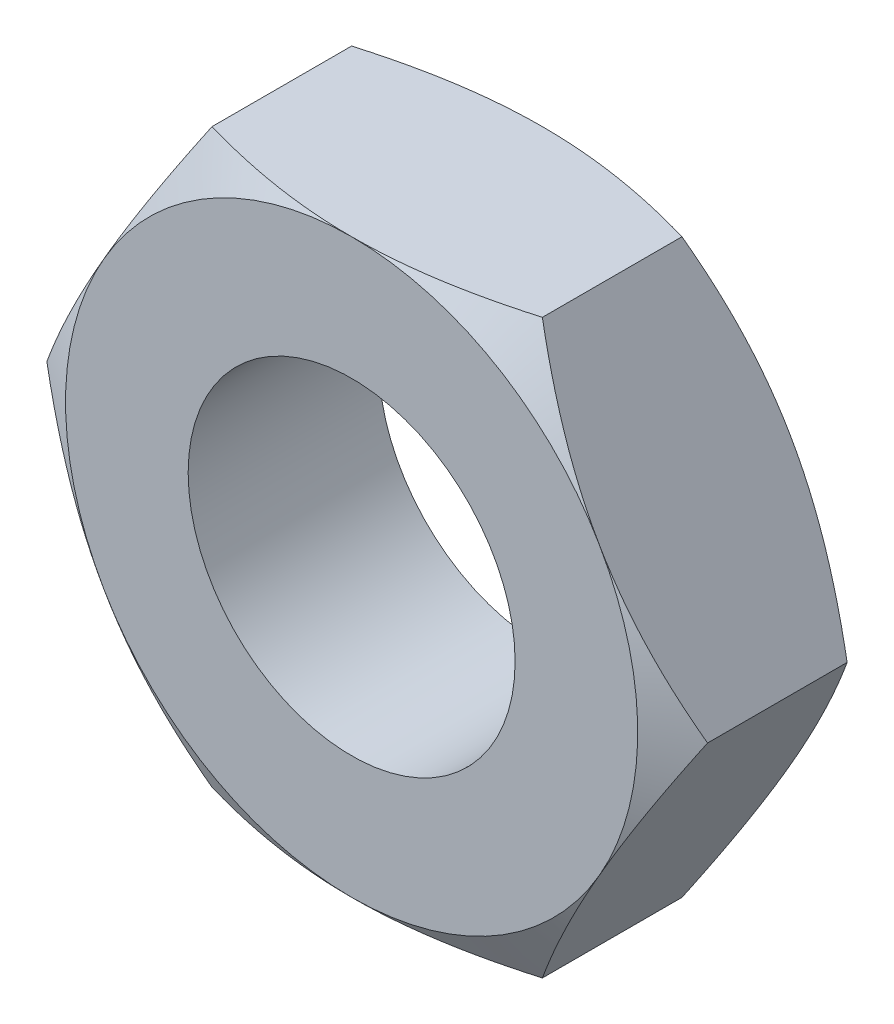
ISO-10303-21;
HEADER;
FILE_DESCRIPTION(('STEP AP214'),'2;1');
FILE_NAME('part.step','',(''),(''),'','','');
FILE_SCHEMA(('AUTOMOTIVE_DESIGN { 1 0 10303 214 1 1 1 1 }'));
ENDSEC;
DATA;
#1=APPLICATION_CONTEXT('core data for automotive mechanical design processes');
#2=APPLICATION_PROTOCOL_DEFINITION('international standard','automotive_design',2000,#1);
#3=PRODUCT_CONTEXT('',#1,'mechanical');
#4=PRODUCT('Part','Part','',(#3));
#5=PRODUCT_RELATED_PRODUCT_CATEGORY('part','',(#4));
#6=PRODUCT_DEFINITION_FORMATION('','',#4);
#7=PRODUCT_DEFINITION_CONTEXT('part definition',#1,'design');
#8=PRODUCT_DEFINITION('design','',#6,#7);
#9=PRODUCT_DEFINITION_SHAPE('','',#8);
#10=(LENGTH_UNIT() NAMED_UNIT(*) SI_UNIT(.MILLI.,.METRE.));
#11=(NAMED_UNIT(*) PLANE_ANGLE_UNIT() SI_UNIT($,.RADIAN.));
#12=(NAMED_UNIT(*) SI_UNIT($,.STERADIAN.) SOLID_ANGLE_UNIT());
#13=UNCERTAINTY_MEASURE_WITH_UNIT(LENGTH_MEASURE(1.E-05),#10,'distance_accuracy_value','');
#14=(GEOMETRIC_REPRESENTATION_CONTEXT(3) GLOBAL_UNCERTAINTY_ASSIGNED_CONTEXT((#13)) GLOBAL_UNIT_ASSIGNED_CONTEXT((#10,
#11,#12)) REPRESENTATION_CONTEXT('',''));
#15=CARTESIAN_POINT('',(0.,0.,0.));
#16=DIRECTION('',(0.,0.,1.));
#17=DIRECTION('',(1.,0.,0.));
#18=AXIS2_PLACEMENT_3D('',#15,#16,#17);
#19=CARTESIAN_POINT('',(-6.06217782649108,-10.5,3.5));
#20=DIRECTION('',(0.,1.,0.));
#21=DIRECTION('',(-1.,0.,0.));
#22=AXIS2_PLACEMENT_3D('',#19,#20,#21);
#23=PLANE('',#22);
#24=CARTESIAN_POINT('',(-16.3129856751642,-10.5,-1.63846950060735));
#25=CARTESIAN_POINT('',(-16.0835361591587,-10.5,-1.52707913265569));
#26=CARTESIAN_POINT('',(-15.8538181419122,-10.5,-1.41624209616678));
#27=CARTESIAN_POINT('',(-15.3937890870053,-10.5,-1.19579997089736));
#28=CARTESIAN_POINT('',(-15.163478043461,-10.5,-1.08619489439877));
#29=CARTESIAN_POINT('',(-14.4715103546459,-10.5,-0.75938680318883));
#30=CARTESIAN_POINT('',(-14.0088866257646,-10.5,-0.544223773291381));
#31=CARTESIAN_POINT('',(-13.0780494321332,-10.5,-0.119481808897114));
#32=CARTESIAN_POINT('',(-12.6098192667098,-10.5,0.0900606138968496));
#33=CARTESIAN_POINT('',(-11.6696450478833,-10.5,0.500610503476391));
#34=CARTESIAN_POINT('',(-11.1977011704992,-10.5,0.701618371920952));
#35=CARTESIAN_POINT('',(-10.2341376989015,-10.5,1.09911565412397));
#36=CARTESIAN_POINT('',(-9.74237234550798,-10.5,1.29525366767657));
#37=CARTESIAN_POINT('',(-8.75310081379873,-10.5,1.67275620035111));
#38=CARTESIAN_POINT('',(-8.25559400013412,-10.5,1.85411906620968));
#39=CARTESIAN_POINT('',(-7.25496302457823,-10.5,2.19733177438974));
#40=CARTESIAN_POINT('',(-6.75185245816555,-10.5,2.35922082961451));
#41=CARTESIAN_POINT('',(-5.73843328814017,-10.5,2.65831332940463));
#42=CARTESIAN_POINT('',(-5.22812699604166,-10.5,2.79552451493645));
#43=CARTESIAN_POINT('',(-4.20270898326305,-10.5,3.03797394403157));
#44=CARTESIAN_POINT('',(-3.68763862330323,-10.5,3.1433824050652));
#45=CARTESIAN_POINT('',(-2.91032009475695,-10.5,3.27307843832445));
#46=CARTESIAN_POINT('',(-2.6504099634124,-10.5,3.31157604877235));
#47=CARTESIAN_POINT('',(-2.12928788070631,-10.5,3.37834473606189));
#48=CARTESIAN_POINT('',(-1.86807605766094,-10.5,3.40661680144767));
#49=CARTESIAN_POINT('',(-1.34812810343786,-10.5,3.45201482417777));
#50=CARTESIAN_POINT('',(-1.08940434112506,-10.5,3.46928188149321));
#51=CARTESIAN_POINT('',(-0.571458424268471,-10.5,3.4928581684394));
#52=CARTESIAN_POINT('',(-0.31223627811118,-10.5,3.49916758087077));
#53=CARTESIAN_POINT('',(0.206244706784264,-10.5,3.50067798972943));
#54=CARTESIAN_POINT('',(0.465503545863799,-10.5,3.49587887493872));
#55=CARTESIAN_POINT('',(0.983587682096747,-10.5,3.47528974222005));
#56=CARTESIAN_POINT('',(1.24241295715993,-10.5,3.45949918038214));
#57=CARTESIAN_POINT('',(1.86344525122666,-10.5,3.40875885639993));
#58=CARTESIAN_POINT('',(2.22523971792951,-10.5,3.36865003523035));
#59=CARTESIAN_POINT('',(2.94614663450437,-10.5,3.26913634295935));
#60=CARTESIAN_POINT('',(3.30525871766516,-10.5,3.20972888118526));
#61=CARTESIAN_POINT('',(4.37814927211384,-10.5,3.00570854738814));
#62=CARTESIAN_POINT('',(5.087093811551,-10.5,2.83533364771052));
#63=CARTESIAN_POINT('',(6.14742972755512,-10.5,2.53978392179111));
#64=CARTESIAN_POINT('',(6.50431432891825,-10.5,2.43318380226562));
#65=CARTESIAN_POINT('',(7.21461615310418,-10.5,2.20889470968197));
#66=CARTESIAN_POINT('',(7.56803335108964,-10.5,2.09120565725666));
#67=CARTESIAN_POINT('',(8.2715143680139,-10.5,1.84662886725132));
#68=CARTESIAN_POINT('',(8.62157922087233,-10.5,1.71974407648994));
#69=CARTESIAN_POINT('',(9.31880400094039,-10.5,1.45827082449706));
#70=CARTESIAN_POINT('',(9.66596397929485,-10.5,1.32368249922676));
#71=CARTESIAN_POINT('',(10.5519074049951,-10.5,0.970716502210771));
#72=CARTESIAN_POINT('',(11.0888481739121,-10.5,0.747719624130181));
#73=CARTESIAN_POINT('',(12.1576434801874,-10.5,0.289814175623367));
#74=CARTESIAN_POINT('',(12.6894975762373,-10.5,0.0549045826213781));
#75=CARTESIAN_POINT('',(13.7491997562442,-10.5,-0.424177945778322));
#76=CARTESIAN_POINT('',(14.2770465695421,-10.5,-0.668353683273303));
#77=CARTESIAN_POINT('',(15.3293262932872,-10.5,-1.16389116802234));
#78=CARTESIAN_POINT('',(15.8537593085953,-10.5,-1.41525269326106));
#79=CARTESIAN_POINT('',(16.9005551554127,-10.5,-1.92402979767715));
#80=CARTESIAN_POINT('',(17.4229142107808,-10.5,-2.18145313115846));
#81=CARTESIAN_POINT('',(18.4653387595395,-10.5,-2.70090348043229));
#82=CARTESIAN_POINT('',(18.9854042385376,-10.5,-2.96293052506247));
#83=CARTESIAN_POINT('',(20.0235379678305,-10.5,-3.49068332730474));
#84=CARTESIAN_POINT('',(20.5416065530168,-10.5,-3.75640842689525));
#85=CARTESIAN_POINT('',(21.5761496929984,-10.5,-4.29094541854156));
#86=CARTESIAN_POINT('',(22.0926242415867,-10.5,-4.55975732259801));
#87=CARTESIAN_POINT('',(23.5406536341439,-10.5,-5.31798326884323));
#88=CARTESIAN_POINT('',(24.4706923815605,-10.5,-5.81029230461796));
#89=CARTESIAN_POINT('',(26.327550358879,-10.5,-6.80103892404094));
#90=CARTESIAN_POINT('',(27.2543694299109,-10.5,-7.29947680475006));
#91=CARTESIAN_POINT('',(29.1028024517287,-10.5,-8.29950657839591));
#92=CARTESIAN_POINT('',(30.0244236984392,-10.5,-8.80108499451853));
#93=CARTESIAN_POINT('',(31.4053681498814,-10.5,-9.55609790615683));
#94=CARTESIAN_POINT('',(31.8654200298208,-10.5,-9.80820146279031));
#95=CARTESIAN_POINT('',(32.7850886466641,-10.5,-10.3131996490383));
#96=CARTESIAN_POINT('',(33.2447053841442,-10.5,-10.5660942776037));
#97=CARTESIAN_POINT('',(33.7041304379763,-10.5,-10.8193367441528));
#98=B_SPLINE_CURVE_WITH_KNOTS('',3,(#24,#25,#26,#27,#28,#29,#30,#31,#32,#33,#34,#35,#36,#37,#38,
#39,#40,#41,#42,#43,#44,#45,#46,#47,#48,#49,#50,#51,#52,#53,#54,#55,#56,#57,#58,#59,#60,#61,#62,
#63,#64,#65,#66,#67,#68,#69,#70,#71,#72,#73,#74,#75,#76,#77,#78,#79,#80,#81,#82,#83,#84,#85,#86,
#87,#88,#89,#90,#91,#92,#93,#94,#95,#96,#97),.UNSPECIFIED.,.F.,.F.,(4,2,2,2,2,2,2,2,2,2,2,2,2,2,
2,2,2,2,2,2,2,2,2,2,2,2,2,2,2,2,2,2,2,2,2,2,4),(0.,0.765174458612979,1.53035653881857,
3.06094582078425,4.59981642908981,6.13861453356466,7.72674066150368,9.31504424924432,
10.9000940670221,12.484645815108,14.0605596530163,14.8486275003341,15.6366191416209,
16.4142928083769,17.1919535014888,17.9696219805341,18.7473289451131,19.8387459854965,
20.9303095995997,23.1146012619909,24.231902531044,25.3492117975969,26.4661645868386,
27.5830976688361,29.3271090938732,31.0712704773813,32.8159635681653,34.5606028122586,
36.3076101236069,38.0546283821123,39.8013396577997,41.5480577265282,44.7049294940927,
47.8619548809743,51.009752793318,52.5835487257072,54.1573425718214),.UNSPECIFIED.);
#99=CARTESIAN_POINT('',(-6.06217782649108,-10.5,2.56217782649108));
#100=VERTEX_POINT('',#99);
#101=CARTESIAN_POINT('',(0.,-10.5,3.5));
#102=VERTEX_POINT('',#101);
#103=EDGE_CURVE('E319',#100,#102,#98,.T.);
#104=ORIENTED_EDGE('',*,*,#103,.F.);
#105=DIRECTION('',(0.,0.,-1.));
#106=VECTOR('',#105,1.);
#107=CARTESIAN_POINT('',(-6.06217782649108,-10.5,3.5));
#108=LINE('',#107,#106);
#109=CARTESIAN_POINT('',(-6.06217782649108,-10.5,-2.56217782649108));
#110=VERTEX_POINT('',#109);
#111=EDGE_CURVE('E228',#100,#110,#108,.T.);
#112=ORIENTED_EDGE('',*,*,#111,.T.);
#113=CARTESIAN_POINT('',(-16.3129856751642,-10.5,1.63846950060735));
#114=CARTESIAN_POINT('',(-16.0835361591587,-10.5,1.52707913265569));
#115=CARTESIAN_POINT('',(-15.8538181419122,-10.5,1.41624209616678));
#116=CARTESIAN_POINT('',(-15.3937890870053,-10.5,1.19579997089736));
#117=CARTESIAN_POINT('',(-15.163478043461,-10.5,1.08619489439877));
#118=CARTESIAN_POINT('',(-14.4715103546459,-10.5,0.75938680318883));
#119=CARTESIAN_POINT('',(-14.0088866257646,-10.5,0.544223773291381));
#120=CARTESIAN_POINT('',(-13.0780494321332,-10.5,0.119481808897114));
#121=CARTESIAN_POINT('',(-12.6098192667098,-10.5,-0.0900606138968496));
#122=CARTESIAN_POINT('',(-11.6696450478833,-10.5,-0.500610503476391));
#123=CARTESIAN_POINT('',(-11.1977011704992,-10.5,-0.701618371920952));
#124=CARTESIAN_POINT('',(-10.2341376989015,-10.5,-1.09911565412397));
#125=CARTESIAN_POINT('',(-9.74237234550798,-10.5,-1.29525366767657));
#126=CARTESIAN_POINT('',(-8.75310081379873,-10.5,-1.67275620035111));
#127=CARTESIAN_POINT('',(-8.25559400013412,-10.5,-1.85411906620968));
#128=CARTESIAN_POINT('',(-7.25496302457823,-10.5,-2.19733177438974));
#129=CARTESIAN_POINT('',(-6.75185245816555,-10.5,-2.35922082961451));
#130=CARTESIAN_POINT('',(-5.73843328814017,-10.5,-2.65831332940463));
#131=CARTESIAN_POINT('',(-5.22812699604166,-10.5,-2.79552451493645));
#132=CARTESIAN_POINT('',(-4.20270898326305,-10.5,-3.03797394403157));
#133=CARTESIAN_POINT('',(-3.68763862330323,-10.5,-3.1433824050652));
#134=CARTESIAN_POINT('',(-2.91032009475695,-10.5,-3.27307843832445));
#135=CARTESIAN_POINT('',(-2.6504099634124,-10.5,-3.31157604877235));
#136=CARTESIAN_POINT('',(-2.12928788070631,-10.5,-3.37834473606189));
#137=CARTESIAN_POINT('',(-1.86807605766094,-10.5,-3.40661680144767));
#138=CARTESIAN_POINT('',(-1.34812810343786,-10.5,-3.45201482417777));
#139=CARTESIAN_POINT('',(-1.08940434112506,-10.5,-3.46928188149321));
#140=CARTESIAN_POINT('',(-0.571458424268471,-10.5,-3.4928581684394));
#141=CARTESIAN_POINT('',(-0.31223627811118,-10.5,-3.49916758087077));
#142=CARTESIAN_POINT('',(0.206244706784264,-10.5,-3.50067798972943));
#143=CARTESIAN_POINT('',(0.465503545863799,-10.5,-3.49587887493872));
#144=CARTESIAN_POINT('',(0.983587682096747,-10.5,-3.47528974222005));
#145=CARTESIAN_POINT('',(1.24241295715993,-10.5,-3.45949918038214));
#146=CARTESIAN_POINT('',(1.86344525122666,-10.5,-3.40875885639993));
#147=CARTESIAN_POINT('',(2.22523971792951,-10.5,-3.36865003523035));
#148=CARTESIAN_POINT('',(2.94614663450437,-10.5,-3.26913634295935));
#149=CARTESIAN_POINT('',(3.30525871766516,-10.5,-3.20972888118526));
#150=CARTESIAN_POINT('',(4.37814927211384,-10.5,-3.00570854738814));
#151=CARTESIAN_POINT('',(5.087093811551,-10.5,-2.83533364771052));
#152=CARTESIAN_POINT('',(6.14742972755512,-10.5,-2.53978392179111));
#153=CARTESIAN_POINT('',(6.50431432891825,-10.5,-2.43318380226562));
#154=CARTESIAN_POINT('',(7.21461615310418,-10.5,-2.20889470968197));
#155=CARTESIAN_POINT('',(7.56803335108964,-10.5,-2.09120565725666));
#156=CARTESIAN_POINT('',(8.2715143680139,-10.5,-1.84662886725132));
#157=CARTESIAN_POINT('',(8.62157922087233,-10.5,-1.71974407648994));
#158=CARTESIAN_POINT('',(9.31880400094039,-10.5,-1.45827082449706));
#159=CARTESIAN_POINT('',(9.66596397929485,-10.5,-1.32368249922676));
#160=CARTESIAN_POINT('',(10.5519074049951,-10.5,-0.970716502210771));
#161=CARTESIAN_POINT('',(11.0888481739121,-10.5,-0.747719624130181));
#162=CARTESIAN_POINT('',(12.1576434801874,-10.5,-0.289814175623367));
#163=CARTESIAN_POINT('',(12.6894975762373,-10.5,-0.0549045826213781));
#164=CARTESIAN_POINT('',(13.7491997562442,-10.5,0.424177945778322));
#165=CARTESIAN_POINT('',(14.2770465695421,-10.5,0.668353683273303));
#166=CARTESIAN_POINT('',(15.3293262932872,-10.5,1.16389116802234));
#167=CARTESIAN_POINT('',(15.8537593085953,-10.5,1.41525269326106));
#168=CARTESIAN_POINT('',(16.9005551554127,-10.5,1.92402979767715));
#169=CARTESIAN_POINT('',(17.4229142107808,-10.5,2.18145313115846));
#170=CARTESIAN_POINT('',(18.4653387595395,-10.5,2.70090348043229));
#171=CARTESIAN_POINT('',(18.9854042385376,-10.5,2.96293052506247));
#172=CARTESIAN_POINT('',(20.0235379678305,-10.5,3.49068332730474));
#173=CARTESIAN_POINT('',(20.5416065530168,-10.5,3.75640842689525));
#174=CARTESIAN_POINT('',(21.5761496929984,-10.5,4.29094541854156));
#175=CARTESIAN_POINT('',(22.0926242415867,-10.5,4.55975732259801));
#176=CARTESIAN_POINT('',(23.5406536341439,-10.5,5.31798326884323));
#177=CARTESIAN_POINT('',(24.4706923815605,-10.5,5.81029230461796));
#178=CARTESIAN_POINT('',(26.327550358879,-10.5,6.80103892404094));
#179=CARTESIAN_POINT('',(27.2543694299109,-10.5,7.29947680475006));
#180=CARTESIAN_POINT('',(29.1028024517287,-10.5,8.29950657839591));
#181=CARTESIAN_POINT('',(30.0244236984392,-10.5,8.80108499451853));
#182=CARTESIAN_POINT('',(31.4053681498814,-10.5,9.55609790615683));
#183=CARTESIAN_POINT('',(31.8654200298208,-10.5,9.80820146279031));
#184=CARTESIAN_POINT('',(32.7850886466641,-10.5,10.3131996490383));
#185=CARTESIAN_POINT('',(33.2447053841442,-10.5,10.5660942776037));
#186=CARTESIAN_POINT('',(33.7041304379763,-10.5,10.8193367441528));
#187=B_SPLINE_CURVE_WITH_KNOTS('',3,(#113,#114,#115,#116,#117,#118,#119,#120,#121,#122,#123,
#124,#125,#126,#127,#128,#129,#130,#131,#132,#133,#134,#135,#136,#137,#138,#139,#140,#141,#142,
#143,#144,#145,#146,#147,#148,#149,#150,#151,#152,#153,#154,#155,#156,#157,#158,#159,#160,#161,
#162,#163,#164,#165,#166,#167,#168,#169,#170,#171,#172,#173,#174,#175,#176,#177,#178,#179,#180,
#181,#182,#183,#184,#185,#186),.UNSPECIFIED.,.F.,.F.,(4,2,2,2,2,2,2,2,2,2,2,2,2,2,2,2,2,2,2,2,2,
2,2,2,2,2,2,2,2,2,2,2,2,2,2,2,4),(0.,0.765174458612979,1.53035653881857,3.06094582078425,
4.59981642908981,6.13861453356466,7.72674066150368,9.31504424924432,10.9000940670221,
12.484645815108,14.0605596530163,14.8486275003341,15.6366191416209,16.4142928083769,
17.1919535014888,17.9696219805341,18.7473289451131,19.8387459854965,20.9303095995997,
23.1146012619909,24.231902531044,25.3492117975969,26.4661645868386,27.5830976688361,
29.3271090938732,31.0712704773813,32.8159635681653,34.5606028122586,36.3076101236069,
38.0546283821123,39.8013396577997,41.5480577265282,44.7049294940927,47.8619548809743,
51.009752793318,52.5835487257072,54.1573425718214),.UNSPECIFIED.);
#188=CARTESIAN_POINT('',(0.,-10.5,-3.5));
#189=VERTEX_POINT('',#188);
#190=EDGE_CURVE('E282',#189,#110,#187,.F.);
#191=ORIENTED_EDGE('',*,*,#190,.F.);
#192=CARTESIAN_POINT('',(6.0621778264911,-10.5,-2.56217782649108));
#193=VERTEX_POINT('',#192);
#194=EDGE_CURVE('E51',#193,#189,#187,.F.);
#195=ORIENTED_EDGE('',*,*,#194,.F.);
#196=DIRECTION('',(0.,0.,-1.));
#197=VECTOR('',#196,1.);
#198=CARTESIAN_POINT('',(6.0621778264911,-10.5,3.5));
#199=LINE('',#198,#197);
#200=CARTESIAN_POINT('',(6.0621778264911,-10.5,2.56217782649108));
#201=VERTEX_POINT('',#200);
#202=EDGE_CURVE('E237',#201,#193,#199,.T.);
#203=ORIENTED_EDGE('',*,*,#202,.F.);
#204=EDGE_CURVE('E195',#102,#201,#98,.T.);
#205=ORIENTED_EDGE('',*,*,#204,.F.);
#206=EDGE_LOOP('',(#104,#112,#191,#195,#203,#205));
#207=FACE_BOUND('',#206,.T.);
#208=ADVANCED_FACE('F29',(#207),#23,.F.);
#209=CARTESIAN_POINT('',(6.0621778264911,-10.5,3.5));
#210=DIRECTION('',(-0.866025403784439,0.5,0.));
#211=DIRECTION('',(-0.5,-0.866025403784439,0.));
#212=AXIS2_PLACEMENT_3D('',#209,#210,#211);
#213=PLANE('',#212);
#214=CARTESIAN_POINT('',(6.06206235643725,-10.5002,2.56211115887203));
#215=CARTESIAN_POINT('',(6.19532217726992,-10.2693872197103,2.63903608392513));
#216=CARTESIAN_POINT('',(6.32907886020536,-10.0377138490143,2.71246961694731));
#217=CARTESIAN_POINT('',(6.59766485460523,-9.57250926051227,2.85138514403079));
#218=CARTESIAN_POINT('',(6.73249450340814,-9.33897745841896,2.91686452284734));
#219=CARTESIAN_POINT('',(7.13915595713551,-8.63461915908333,3.10010423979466));
#220=CARTESIAN_POINT('',(7.4125931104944,-8.16101211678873,3.20433004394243));
#221=CARTESIAN_POINT('',(7.82177929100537,-7.45228086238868,3.32654435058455));
#222=CARTESIAN_POINT('',(7.95630585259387,-7.21927402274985,3.36135857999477));
#223=CARTESIAN_POINT('',(8.22598182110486,-6.75218154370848,3.41973973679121));
#224=CARTESIAN_POINT('',(8.36113123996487,-6.51809588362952,3.44330644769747));
#225=CARTESIAN_POINT('',(8.63165551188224,-6.04953409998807,3.47858873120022));
#226=CARTESIAN_POINT('',(8.76702990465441,-5.81505877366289,3.49031838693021));
#227=CARTESIAN_POINT('',(9.03790372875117,-5.3458915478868,3.50167731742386));
#228=CARTESIAN_POINT('',(9.17340315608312,-5.11119965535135,3.50130696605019));
#229=CARTESIAN_POINT('',(9.42672188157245,-4.67243875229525,3.48930773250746));
#230=CARTESIAN_POINT('',(9.544559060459,-4.4683387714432,3.47914260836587));
#231=CARTESIAN_POINT('',(9.77995782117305,-4.06061615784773,3.44985839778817));
#232=CARTESIAN_POINT('',(9.89751938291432,-3.8569935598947,3.4307386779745));
#233=CARTESIAN_POINT('',(10.2497485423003,-3.24691475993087,3.3603996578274));
#234=CARTESIAN_POINT('',(10.4837926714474,-2.84153843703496,3.29620926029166));
#235=CARTESIAN_POINT('',(10.9543635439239,-2.02648577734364,3.13573291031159));
#236=CARTESIAN_POINT('',(11.1908302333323,-1.61691345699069,3.03876673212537));
#237=CARTESIAN_POINT('',(11.6602373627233,-0.803876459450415,2.81869386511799));
#238=CARTESIAN_POINT('',(11.8931838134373,-0.400401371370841,2.6956388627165));
#239=CARTESIAN_POINT('',(12.124471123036,0.000200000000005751,2.56211115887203));
#240=B_SPLINE_CURVE_WITH_KNOTS('',3,(#214,#215,#216,#217,#218,#219,#220,#221,#222,#223,#224,
#225,#226,#227,#228,#229,#230,#231,#232,#233,#234,#235,#236,#237,#238,#239),.UNSPECIFIED.,.F.,
.F.,(4,2,2,2,2,2,2,2,2,2,2,2,4),(0.,0.832130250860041,1.66453336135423,3.33288308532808,
4.14658222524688,4.9602970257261,5.77304256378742,6.58576298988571,7.29326708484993,
8.00082123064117,9.41693497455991,10.864454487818,12.3091325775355),.UNSPECIFIED.);
#241=CARTESIAN_POINT('',(9.09326673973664,-5.25,3.5));
#242=VERTEX_POINT('',#241);
#243=EDGE_CURVE('E193',#201,#242,#240,.T.);
#244=ORIENTED_EDGE('',*,*,#243,.F.);
#245=ORIENTED_EDGE('',*,*,#202,.T.);
#246=CARTESIAN_POINT('',(12.124471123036,0.000200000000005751,-2.56211115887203));
#247=CARTESIAN_POINT('',(11.9912113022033,-0.230612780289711,-2.63903608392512));
#248=CARTESIAN_POINT('',(11.8574546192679,-0.462286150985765,-2.71246961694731));
#249=CARTESIAN_POINT('',(11.588868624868,-0.927490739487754,-2.85138514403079));
#250=CARTESIAN_POINT('',(11.4540389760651,-1.16102254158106,-2.91686452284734));
#251=CARTESIAN_POINT('',(11.0473775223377,-1.86538084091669,-3.10010423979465));
#252=CARTESIAN_POINT('',(10.7739403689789,-2.33898788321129,-3.20433004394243));
#253=CARTESIAN_POINT('',(10.3647541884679,-3.04771913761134,-3.32654435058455));
#254=CARTESIAN_POINT('',(10.2302276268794,-3.28072597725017,-3.36135857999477));
#255=CARTESIAN_POINT('',(9.9605516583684,-3.74781845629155,-3.4197397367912));
#256=CARTESIAN_POINT('',(9.82540223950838,-3.9819041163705,-3.44330644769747));
#257=CARTESIAN_POINT('',(9.55487796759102,-4.45046590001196,-3.47858873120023));
#258=CARTESIAN_POINT('',(9.41950357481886,-4.68494122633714,-3.49031838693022));
#259=CARTESIAN_POINT('',(9.14862975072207,-5.15410845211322,-3.50167731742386));
#260=CARTESIAN_POINT('',(9.01313032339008,-5.38880034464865,-3.50130696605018));
#261=CARTESIAN_POINT('',(8.75981159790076,-5.82756124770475,-3.48930773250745));
#262=CARTESIAN_POINT('',(8.64197441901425,-6.03166122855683,-3.47914260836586));
#263=CARTESIAN_POINT('',(8.40657565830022,-6.43938384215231,-3.44985839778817));
#264=CARTESIAN_POINT('',(8.28901409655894,-6.64300644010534,-3.4307386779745));
#265=CARTESIAN_POINT('',(7.93678493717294,-7.25308524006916,-3.36039965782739));
#266=CARTESIAN_POINT('',(7.70274080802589,-7.65846156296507,-3.29620926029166));
#267=CARTESIAN_POINT('',(7.23216993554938,-8.47351422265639,-3.13573291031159));
#268=CARTESIAN_POINT('',(6.99570324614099,-8.88308654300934,-3.03876673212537));
#269=CARTESIAN_POINT('',(6.52629611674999,-9.69612354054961,-2.81869386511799));
#270=CARTESIAN_POINT('',(6.29334966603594,-10.0995986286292,-2.6956388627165));
#271=CARTESIAN_POINT('',(6.06206235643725,-10.5002,-2.56211115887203));
#272=B_SPLINE_CURVE_WITH_KNOTS('',3,(#246,#247,#248,#249,#250,#251,#252,#253,#254,#255,#256,
#257,#258,#259,#260,#261,#262,#263,#264,#265,#266,#267,#268,#269,#270,#271),.UNSPECIFIED.,.F.,
.F.,(4,2,2,2,2,2,2,2,2,2,2,2,4),(0.,0.832130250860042,1.66453336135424,3.33288308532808,
4.14658222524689,4.96029702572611,5.77304256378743,6.58576298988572,7.29326708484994,
8.00082123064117,9.41693497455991,10.864454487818,12.3091325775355),.UNSPECIFIED.);
#273=CARTESIAN_POINT('',(9.09326673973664,-5.25,-3.5));
#274=VERTEX_POINT('',#273);
#275=EDGE_CURVE('E208',#274,#193,#272,.T.);
#276=ORIENTED_EDGE('',*,*,#275,.F.);
#277=CARTESIAN_POINT('',(12.1243556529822,0.,-2.56217782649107));
#278=VERTEX_POINT('',#277);
#279=EDGE_CURVE('E214',#278,#274,#272,.T.);
#280=ORIENTED_EDGE('',*,*,#279,.F.);
#281=DIRECTION('',(0.,0.,-1.));
#282=VECTOR('',#281,1.);
#283=CARTESIAN_POINT('',(12.1243556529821,0.,3.5));
#284=LINE('',#283,#282);
#285=CARTESIAN_POINT('',(12.1243556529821,0.,2.56217782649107));
#286=VERTEX_POINT('',#285);
#287=EDGE_CURVE('E235',#286,#278,#284,.T.);
#288=ORIENTED_EDGE('',*,*,#287,.F.);
#289=EDGE_CURVE('E189',#242,#286,#240,.T.);
#290=ORIENTED_EDGE('',*,*,#289,.F.);
#291=EDGE_LOOP('',(#244,#245,#276,#280,#288,#290));
#292=FACE_BOUND('',#291,.T.);
#293=ADVANCED_FACE('F200',(#292),#213,.F.);
#294=CARTESIAN_POINT('',(12.1243556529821,0.,3.5));
#295=DIRECTION('',(-0.866025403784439,-0.5,0.));
#296=DIRECTION('',(0.5,-0.866025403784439,0.));
#297=AXIS2_PLACEMENT_3D('',#294,#295,#296);
#298=PLANE('',#297);
#299=CARTESIAN_POINT('',(12.124471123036,-0.000199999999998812,2.56211115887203));
#300=CARTESIAN_POINT('',(11.9912113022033,0.230612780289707,2.63903608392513));
#301=CARTESIAN_POINT('',(11.8574546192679,0.462286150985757,2.71246961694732));
#302=CARTESIAN_POINT('',(11.588868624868,0.927490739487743,2.8513851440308));
#303=CARTESIAN_POINT('',(11.4540389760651,1.16102254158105,2.91686452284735));
#304=CARTESIAN_POINT('',(11.0473775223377,1.86538084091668,3.10010423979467));
#305=CARTESIAN_POINT('',(10.7739403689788,2.33898788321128,3.20433004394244));
#306=CARTESIAN_POINT('',(10.3647541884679,3.04771913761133,3.32654435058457));
#307=CARTESIAN_POINT('',(10.2302276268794,3.28072597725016,3.36135857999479));
#308=CARTESIAN_POINT('',(9.96055165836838,3.74781845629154,3.41973973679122));
#309=CARTESIAN_POINT('',(9.82540223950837,3.98190411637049,3.44330644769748));
#310=CARTESIAN_POINT('',(9.554877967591,4.45046590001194,3.47858873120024));
#311=CARTESIAN_POINT('',(9.41950357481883,4.68494122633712,3.49031838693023));
#312=CARTESIAN_POINT('',(9.14862975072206,5.15410845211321,3.50167731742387));
#313=CARTESIAN_POINT('',(9.0131303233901,5.38880034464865,3.50130696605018));
#314=CARTESIAN_POINT('',(8.75981159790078,5.82756124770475,3.48930773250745));
#315=CARTESIAN_POINT('',(8.64197441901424,6.03166122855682,3.47914260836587));
#316=CARTESIAN_POINT('',(8.4065756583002,6.43938384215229,3.44985839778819));
#317=CARTESIAN_POINT('',(8.28901409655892,6.64300644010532,3.43073867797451));
#318=CARTESIAN_POINT('',(7.93678493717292,7.25308524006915,3.36039965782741));
#319=CARTESIAN_POINT('',(7.70274080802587,7.65846156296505,3.29620926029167));
#320=CARTESIAN_POINT('',(7.23216993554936,8.47351422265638,3.1357329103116));
#321=CARTESIAN_POINT('',(6.99570324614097,8.88308654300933,3.03876673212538));
#322=CARTESIAN_POINT('',(6.52629611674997,9.6961235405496,2.81869386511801));
#323=CARTESIAN_POINT('',(6.29334966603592,10.0995986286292,2.69563886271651));
#324=CARTESIAN_POINT('',(6.06206235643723,10.5002,2.56211115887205));
#325=B_SPLINE_CURVE_WITH_KNOTS('',3,(#299,#300,#301,#302,#303,#304,#305,#306,#307,#308,#309,
#310,#311,#312,#313,#314,#315,#316,#317,#318,#319,#320,#321,#322,#323,#324),.UNSPECIFIED.,.F.,
.F.,(4,2,2,2,2,2,2,2,2,2,2,2,4),(0.,0.832130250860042,1.66453336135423,3.33288308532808,
4.14658222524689,4.9602970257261,5.77304256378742,6.58576298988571,7.29326708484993,
8.00082123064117,9.41693497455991,10.864454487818,12.3091325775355),.UNSPECIFIED.);
#326=CARTESIAN_POINT('',(9.09326673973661,5.25,3.5));
#327=VERTEX_POINT('',#326);
#328=EDGE_CURVE('E194',#286,#327,#325,.T.);
#329=ORIENTED_EDGE('',*,*,#328,.F.);
#330=ORIENTED_EDGE('',*,*,#287,.T.);
#331=CARTESIAN_POINT('',(6.06206235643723,10.5002,-2.56211115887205));
#332=CARTESIAN_POINT('',(6.1953221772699,10.2693872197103,-2.63903608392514));
#333=CARTESIAN_POINT('',(6.32907886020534,10.0377138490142,-2.71246961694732));
#334=CARTESIAN_POINT('',(6.59766485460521,9.57250926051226,-2.8513851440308));
#335=CARTESIAN_POINT('',(6.73249450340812,9.33897745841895,-2.91686452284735));
#336=CARTESIAN_POINT('',(7.13915595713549,8.63461915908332,-3.10010423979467));
#337=CARTESIAN_POINT('',(7.41259311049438,8.16101211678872,-3.20433004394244));
#338=CARTESIAN_POINT('',(7.82177929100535,7.45228086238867,-3.32654435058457));
#339=CARTESIAN_POINT('',(7.95630585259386,7.21927402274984,-3.36135857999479));
#340=CARTESIAN_POINT('',(8.22598182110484,6.75218154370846,-3.41973973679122));
#341=CARTESIAN_POINT('',(8.36113123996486,6.51809588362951,-3.44330644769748));
#342=CARTESIAN_POINT('',(8.63165551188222,6.04953409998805,-3.47858873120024));
#343=CARTESIAN_POINT('',(8.76702990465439,5.81505877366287,-3.49031838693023));
#344=CARTESIAN_POINT('',(9.03790372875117,5.34589154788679,-3.50167731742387));
#345=CARTESIAN_POINT('',(9.17340315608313,5.11119965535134,-3.50130696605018));
#346=CARTESIAN_POINT('',(9.42672188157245,4.67243875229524,-3.48930773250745));
#347=CARTESIAN_POINT('',(9.54455906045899,4.46833877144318,-3.47914260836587));
#348=CARTESIAN_POINT('',(9.77995782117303,4.06061615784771,-3.44985839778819));
#349=CARTESIAN_POINT('',(9.8975193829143,3.85699355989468,-3.43073867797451));
#350=CARTESIAN_POINT('',(10.2497485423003,3.24691475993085,-3.3603996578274));
#351=CARTESIAN_POINT('',(10.4837926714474,2.84153843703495,-3.29620926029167));
#352=CARTESIAN_POINT('',(10.9543635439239,2.02648577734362,-3.1357329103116));
#353=CARTESIAN_POINT('',(11.1908302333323,1.61691345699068,-3.03876673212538));
#354=CARTESIAN_POINT('',(11.6602373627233,0.803876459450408,-2.818693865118));
#355=CARTESIAN_POINT('',(11.8931838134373,0.400401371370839,-2.69563886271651));
#356=CARTESIAN_POINT('',(12.124471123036,-0.000199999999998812,-2.56211115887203));
#357=B_SPLINE_CURVE_WITH_KNOTS('',3,(#331,#332,#333,#334,#335,#336,#337,#338,#339,#340,#341,
#342,#343,#344,#345,#346,#347,#348,#349,#350,#351,#352,#353,#354,#355,#356),.UNSPECIFIED.,.F.,
.F.,(4,2,2,2,2,2,2,2,2,2,2,2,4),(0.,0.832130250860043,1.66453336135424,3.33288308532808,
4.14658222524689,4.96029702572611,5.77304256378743,6.58576298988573,7.29326708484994,
8.00082123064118,9.41693497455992,10.864454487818,12.3091325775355),.UNSPECIFIED.);
#358=CARTESIAN_POINT('',(9.09326673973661,5.25,-3.5));
#359=VERTEX_POINT('',#358);
#360=EDGE_CURVE('E220',#359,#278,#357,.T.);
#361=ORIENTED_EDGE('',*,*,#360,.F.);
#362=CARTESIAN_POINT('',(6.06217782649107,10.5,-2.56217782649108));
#363=VERTEX_POINT('',#362);
#364=EDGE_CURVE('E226',#363,#359,#357,.T.);
#365=ORIENTED_EDGE('',*,*,#364,.F.);
#366=DIRECTION('',(0.,0.,-1.));
#367=VECTOR('',#366,1.);
#368=CARTESIAN_POINT('',(6.06217782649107,10.5,3.5));
#369=LINE('',#368,#367);
#370=CARTESIAN_POINT('',(6.06217782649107,10.5,2.56217782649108));
#371=VERTEX_POINT('',#370);
#372=EDGE_CURVE('E233',#371,#363,#369,.T.);
#373=ORIENTED_EDGE('',*,*,#372,.F.);
#374=EDGE_CURVE('E183',#327,#371,#325,.T.);
#375=ORIENTED_EDGE('',*,*,#374,.F.);
#376=EDGE_LOOP('',(#329,#330,#361,#365,#373,#375));
#377=FACE_BOUND('',#376,.T.);
#378=ADVANCED_FACE('F203',(#377),#298,.F.);
#379=CARTESIAN_POINT('',(6.06217782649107,10.5,3.5));
#380=DIRECTION('',(0.,-1.,0.));
#381=DIRECTION('',(1.,0.,0.));
#382=AXIS2_PLACEMENT_3D('',#379,#380,#381);
#383=PLANE('',#382);
#384=CARTESIAN_POINT('',(-16.3129856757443,10.5,-1.63846950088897));
#385=CARTESIAN_POINT('',(-16.0835361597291,10.5,-1.52707913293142));
#386=CARTESIAN_POINT('',(-15.8538181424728,10.5,-1.41624209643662));
#387=CARTESIAN_POINT('',(-15.3937890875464,10.5,-1.19579997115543));
#388=CARTESIAN_POINT('',(-15.1634780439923,10.5,-1.08619489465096));
#389=CARTESIAN_POINT('',(-14.4715103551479,10.5,-0.759386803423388));
#390=CARTESIAN_POINT('',(-14.008886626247,10.5,-0.544223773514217));
#391=CARTESIAN_POINT('',(-13.0780494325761,10.5,-0.119481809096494));
#392=CARTESIAN_POINT('',(-12.6098192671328,10.5,0.0900606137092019));
#393=CARTESIAN_POINT('',(-11.6696450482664,10.5,0.500610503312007));
#394=CARTESIAN_POINT('',(-11.1977011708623,10.5,0.701618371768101));
#395=CARTESIAN_POINT('',(-10.2341376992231,10.5,1.09911565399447));
#396=CARTESIAN_POINT('',(-9.74237234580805,10.5,1.29525366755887));
#397=CARTESIAN_POINT('',(-8.75310081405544,10.5,1.67275620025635));
#398=CARTESIAN_POINT('',(-8.25559400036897,10.5,1.85411906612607));
#399=CARTESIAN_POINT('',(-7.25496302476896,10.5,2.19733177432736));
#400=CARTESIAN_POINT('',(-6.75185245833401,10.5,2.35922082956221));
#401=CARTESIAN_POINT('',(-5.7384332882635,10.5,2.65831332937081));
#402=CARTESIAN_POINT('',(-5.22812699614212,10.5,2.79552451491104));
#403=CARTESIAN_POINT('',(-4.20270898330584,10.5,3.03797394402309));
#404=CARTESIAN_POINT('',(-3.68763862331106,10.5,3.14338240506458));
#405=CARTESIAN_POINT('',(-2.91032009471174,10.5,3.27307843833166));
#406=CARTESIAN_POINT('',(-2.65040996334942,10.5,3.3115760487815));
#407=CARTESIAN_POINT('',(-2.12928788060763,10.5,3.37834473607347));
#408=CARTESIAN_POINT('',(-1.86807605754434,10.5,3.40661680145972));
#409=CARTESIAN_POINT('',(-1.34812810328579,10.5,3.45201482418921));
#410=CARTESIAN_POINT('',(-1.08940434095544,10.5,3.46928188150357));
#411=CARTESIAN_POINT('',(-0.571458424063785,10.5,3.49285816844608));
#412=CARTESIAN_POINT('',(-0.312236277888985,10.5,3.49916758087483));
#413=CARTESIAN_POINT('',(0.206244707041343,10.5,3.50067798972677));
#414=CARTESIAN_POINT('',(0.465503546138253,10.5,3.49587887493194));
#415=CARTESIAN_POINT('',(0.983587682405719,10.5,3.47528974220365));
#416=CARTESIAN_POINT('',(1.24241295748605,10.5,3.45949918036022));
#417=CARTESIAN_POINT('',(1.86344525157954,10.5,3.40875885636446));
#418=CARTESIAN_POINT('',(2.22523971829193,10.5,3.36865003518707));
#419=CARTESIAN_POINT('',(2.94614663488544,10.5,3.26913634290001));
#420=CARTESIAN_POINT('',(3.30525871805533,10.5,3.20972888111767));
#421=CARTESIAN_POINT('',(4.37814927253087,10.5,3.00570854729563));
#422=CARTESIAN_POINT('',(5.08709381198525,10.5,2.83533364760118));
#423=CARTESIAN_POINT('',(6.14742972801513,10.5,2.53978392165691));
#424=CARTESIAN_POINT('',(6.50431432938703,10.5,2.43318380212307));
#425=CARTESIAN_POINT('',(7.2146161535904,10.5,2.20889470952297));
#426=CARTESIAN_POINT('',(7.56803335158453,10.5,2.09120565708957));
#427=CARTESIAN_POINT('',(8.27151436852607,10.5,1.8466288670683));
#428=CARTESIAN_POINT('',(8.62157922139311,10.5,1.71974407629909));
#429=CARTESIAN_POINT('',(9.31880400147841,10.5,1.45827082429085));
#430=CARTESIAN_POINT('',(9.66596397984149,10.5,1.323682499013));
#431=CARTESIAN_POINT('',(10.5519074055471,10.5,0.970716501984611));
#432=CARTESIAN_POINT('',(11.0888481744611,10.5,0.747719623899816));
#433=CARTESIAN_POINT('',(12.1576434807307,10.5,0.289814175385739));
#434=CARTESIAN_POINT('',(12.689497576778,10.5,0.0549045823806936));
#435=CARTESIAN_POINT('',(13.7491997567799,10.5,-0.424177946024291));
#436=CARTESIAN_POINT('',(14.2770465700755,10.5,-0.668353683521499));
#437=CARTESIAN_POINT('',(15.3293262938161,10.5,-1.16389116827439));
#438=CARTESIAN_POINT('',(15.8537593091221,10.5,-1.41525269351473));
#439=CARTESIAN_POINT('',(16.9005551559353,10.5,-1.92402979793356));
#440=CARTESIAN_POINT('',(17.4229142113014,10.5,-2.18145313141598));
#441=CARTESIAN_POINT('',(18.4653387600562,10.5,-2.70090348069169));
#442=CARTESIAN_POINT('',(18.9854042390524,10.5,-2.96293052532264));
#443=CARTESIAN_POINT('',(20.0235379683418,10.5,-3.4906833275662));
#444=CARTESIAN_POINT('',(20.5416065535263,10.5,-3.75640842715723));
#445=CARTESIAN_POINT('',(21.5761496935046,10.5,-4.29094541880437));
#446=CARTESIAN_POINT('',(22.0926242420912,10.5,-4.55975732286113));
#447=CARTESIAN_POINT('',(23.5406536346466,10.5,-5.31798326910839));
#448=CARTESIAN_POINT('',(24.4706923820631,10.5,-5.8102923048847));
#449=CARTESIAN_POINT('',(26.3275503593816,10.5,-6.8010389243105));
#450=CARTESIAN_POINT('',(27.2543694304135,10.5,-7.29947680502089));
#451=CARTESIAN_POINT('',(29.1028024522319,10.5,-8.29950657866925));
#452=CARTESIAN_POINT('',(30.024423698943,10.5,-8.80108499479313));
#453=CARTESIAN_POINT('',(31.4053681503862,10.5,-9.55609790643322));
#454=CARTESIAN_POINT('',(31.8654200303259,10.5,-9.80820146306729));
#455=CARTESIAN_POINT('',(32.7850886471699,10.5,-10.3131996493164));
#456=CARTESIAN_POINT('',(33.2447053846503,10.5,-10.5660942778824));
#457=CARTESIAN_POINT('',(33.7041304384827,10.5,-10.819336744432));
#458=B_SPLINE_CURVE_WITH_KNOTS('',3,(#384,#385,#386,#387,#388,#389,#390,#391,#392,#393,#394,
#395,#396,#397,#398,#399,#400,#401,#402,#403,#404,#405,#406,#407,#408,#409,#410,#411,#412,#413,
#414,#415,#416,#417,#418,#419,#420,#421,#422,#423,#424,#425,#426,#427,#428,#429,#430,#431,#432,
#433,#434,#435,#436,#437,#438,#439,#440,#441,#442,#443,#444,#445,#446,#447,#448,#449,#450,#451,
#452,#453,#454,#455,#456,#457),.UNSPECIFIED.,.F.,.F.,(4,2,2,2,2,2,2,2,2,2,2,2,2,2,2,2,2,2,2,2,2,
2,2,2,2,2,2,2,2,2,2,2,2,2,2,2,4),(0.,0.765174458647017,1.53035653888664,3.06094582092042,
4.59981642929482,6.1386145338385,7.72674066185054,9.31504424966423,10.9000940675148,
12.4846458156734,14.060559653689,14.8486275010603,15.6366191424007,16.414292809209,
17.1919535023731,17.9696219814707,18.7473289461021,19.8387459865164,20.9303096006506,
23.1146012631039,24.2319025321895,25.3492117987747,26.4661645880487,27.5830976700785,
29.3271090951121,31.0712704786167,32.8159635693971,34.5606028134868,36.3076101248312,
38.0546283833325,39.801339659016,41.5480577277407,44.7049294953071,47.8619548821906,
51.0097527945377,52.5835487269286,54.1573425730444),.UNSPECIFIED.);
#459=CARTESIAN_POINT('',(0.,10.5,3.5));
#460=VERTEX_POINT('',#459);
#461=EDGE_CURVE('E328',#371,#460,#458,.F.);
#462=ORIENTED_EDGE('',*,*,#461,.F.);
#463=ORIENTED_EDGE('',*,*,#372,.T.);
#464=CARTESIAN_POINT('',(-16.3129856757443,10.5,1.63846950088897));
#465=CARTESIAN_POINT('',(-16.0835361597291,10.5,1.52707913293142));
#466=CARTESIAN_POINT('',(-15.8538181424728,10.5,1.41624209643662));
#467=CARTESIAN_POINT('',(-15.3937890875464,10.5,1.19579997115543));
#468=CARTESIAN_POINT('',(-15.1634780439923,10.5,1.08619489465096));
#469=CARTESIAN_POINT('',(-14.4715103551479,10.5,0.759386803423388));
#470=CARTESIAN_POINT('',(-14.008886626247,10.5,0.544223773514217));
#471=CARTESIAN_POINT('',(-13.0780494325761,10.5,0.119481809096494));
#472=CARTESIAN_POINT('',(-12.6098192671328,10.5,-0.0900606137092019));
#473=CARTESIAN_POINT('',(-11.6696450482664,10.5,-0.500610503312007));
#474=CARTESIAN_POINT('',(-11.1977011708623,10.5,-0.701618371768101));
#475=CARTESIAN_POINT('',(-10.2341376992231,10.5,-1.09911565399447));
#476=CARTESIAN_POINT('',(-9.74237234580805,10.5,-1.29525366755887));
#477=CARTESIAN_POINT('',(-8.75310081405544,10.5,-1.67275620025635));
#478=CARTESIAN_POINT('',(-8.25559400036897,10.5,-1.85411906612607));
#479=CARTESIAN_POINT('',(-7.25496302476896,10.5,-2.19733177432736));
#480=CARTESIAN_POINT('',(-6.75185245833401,10.5,-2.35922082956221));
#481=CARTESIAN_POINT('',(-5.7384332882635,10.5,-2.65831332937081));
#482=CARTESIAN_POINT('',(-5.22812699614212,10.5,-2.79552451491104));
#483=CARTESIAN_POINT('',(-4.20270898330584,10.5,-3.03797394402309));
#484=CARTESIAN_POINT('',(-3.68763862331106,10.5,-3.14338240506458));
#485=CARTESIAN_POINT('',(-2.91032009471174,10.5,-3.27307843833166));
#486=CARTESIAN_POINT('',(-2.65040996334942,10.5,-3.3115760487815));
#487=CARTESIAN_POINT('',(-2.12928788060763,10.5,-3.37834473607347));
#488=CARTESIAN_POINT('',(-1.86807605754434,10.5,-3.40661680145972));
#489=CARTESIAN_POINT('',(-1.34812810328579,10.5,-3.45201482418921));
#490=CARTESIAN_POINT('',(-1.08940434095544,10.5,-3.46928188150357));
#491=CARTESIAN_POINT('',(-0.571458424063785,10.5,-3.49285816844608));
#492=CARTESIAN_POINT('',(-0.312236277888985,10.5,-3.49916758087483));
#493=CARTESIAN_POINT('',(0.206244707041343,10.5,-3.50067798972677));
#494=CARTESIAN_POINT('',(0.465503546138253,10.5,-3.49587887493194));
#495=CARTESIAN_POINT('',(0.983587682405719,10.5,-3.47528974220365));
#496=CARTESIAN_POINT('',(1.24241295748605,10.5,-3.45949918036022));
#497=CARTESIAN_POINT('',(1.86344525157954,10.5,-3.40875885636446));
#498=CARTESIAN_POINT('',(2.22523971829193,10.5,-3.36865003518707));
#499=CARTESIAN_POINT('',(2.94614663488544,10.5,-3.26913634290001));
#500=CARTESIAN_POINT('',(3.30525871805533,10.5,-3.20972888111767));
#501=CARTESIAN_POINT('',(4.37814927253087,10.5,-3.00570854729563));
#502=CARTESIAN_POINT('',(5.08709381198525,10.5,-2.83533364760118));
#503=CARTESIAN_POINT('',(6.14742972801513,10.5,-2.53978392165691));
#504=CARTESIAN_POINT('',(6.50431432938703,10.5,-2.43318380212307));
#505=CARTESIAN_POINT('',(7.2146161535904,10.5,-2.20889470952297));
#506=CARTESIAN_POINT('',(7.56803335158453,10.5,-2.09120565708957));
#507=CARTESIAN_POINT('',(8.27151436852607,10.5,-1.8466288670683));
#508=CARTESIAN_POINT('',(8.62157922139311,10.5,-1.71974407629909));
#509=CARTESIAN_POINT('',(9.31880400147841,10.5,-1.45827082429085));
#510=CARTESIAN_POINT('',(9.66596397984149,10.5,-1.323682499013));
#511=CARTESIAN_POINT('',(10.5519074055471,10.5,-0.970716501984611));
#512=CARTESIAN_POINT('',(11.0888481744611,10.5,-0.747719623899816));
#513=CARTESIAN_POINT('',(12.1576434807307,10.5,-0.289814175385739));
#514=CARTESIAN_POINT('',(12.689497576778,10.5,-0.0549045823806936));
#515=CARTESIAN_POINT('',(13.7491997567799,10.5,0.424177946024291));
#516=CARTESIAN_POINT('',(14.2770465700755,10.5,0.668353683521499));
#517=CARTESIAN_POINT('',(15.3293262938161,10.5,1.16389116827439));
#518=CARTESIAN_POINT('',(15.8537593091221,10.5,1.41525269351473));
#519=CARTESIAN_POINT('',(16.9005551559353,10.5,1.92402979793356));
#520=CARTESIAN_POINT('',(17.4229142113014,10.5,2.18145313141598));
#521=CARTESIAN_POINT('',(18.4653387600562,10.5,2.70090348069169));
#522=CARTESIAN_POINT('',(18.9854042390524,10.5,2.96293052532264));
#523=CARTESIAN_POINT('',(20.0235379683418,10.5,3.4906833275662));
#524=CARTESIAN_POINT('',(20.5416065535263,10.5,3.75640842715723));
#525=CARTESIAN_POINT('',(21.5761496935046,10.5,4.29094541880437));
#526=CARTESIAN_POINT('',(22.0926242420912,10.5,4.55975732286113));
#527=CARTESIAN_POINT('',(23.5406536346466,10.5,5.31798326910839));
#528=CARTESIAN_POINT('',(24.4706923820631,10.5,5.8102923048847));
#529=CARTESIAN_POINT('',(26.3275503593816,10.5,6.8010389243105));
#530=CARTESIAN_POINT('',(27.2543694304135,10.5,7.29947680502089));
#531=CARTESIAN_POINT('',(29.1028024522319,10.5,8.29950657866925));
#532=CARTESIAN_POINT('',(30.024423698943,10.5,8.80108499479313));
#533=CARTESIAN_POINT('',(31.4053681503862,10.5,9.55609790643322));
#534=CARTESIAN_POINT('',(31.8654200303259,10.5,9.80820146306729));
#535=CARTESIAN_POINT('',(32.7850886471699,10.5,10.3131996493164));
#536=CARTESIAN_POINT('',(33.2447053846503,10.5,10.5660942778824));
#537=CARTESIAN_POINT('',(33.7041304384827,10.5,10.819336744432));
#538=B_SPLINE_CURVE_WITH_KNOTS('',3,(#464,#465,#466,#467,#468,#469,#470,#471,#472,#473,#474,
#475,#476,#477,#478,#479,#480,#481,#482,#483,#484,#485,#486,#487,#488,#489,#490,#491,#492,#493,
#494,#495,#496,#497,#498,#499,#500,#501,#502,#503,#504,#505,#506,#507,#508,#509,#510,#511,#512,
#513,#514,#515,#516,#517,#518,#519,#520,#521,#522,#523,#524,#525,#526,#527,#528,#529,#530,#531,
#532,#533,#534,#535,#536,#537),.UNSPECIFIED.,.F.,.F.,(4,2,2,2,2,2,2,2,2,2,2,2,2,2,2,2,2,2,2,2,2,
2,2,2,2,2,2,2,2,2,2,2,2,2,2,2,4),(0.,0.765174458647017,1.53035653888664,3.06094582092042,
4.59981642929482,6.1386145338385,7.72674066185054,9.31504424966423,10.9000940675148,
12.4846458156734,14.060559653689,14.8486275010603,15.6366191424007,16.414292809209,
17.1919535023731,17.9696219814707,18.7473289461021,19.8387459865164,20.9303096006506,
23.1146012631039,24.2319025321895,25.3492117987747,26.4661645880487,27.5830976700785,
29.3271090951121,31.0712704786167,32.8159635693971,34.5606028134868,36.3076101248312,
38.0546283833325,39.801339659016,41.5480577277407,44.7049294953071,47.8619548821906,
51.0097527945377,52.5835487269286,54.1573425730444),.UNSPECIFIED.);
#539=CARTESIAN_POINT('',(0.,10.5,-3.5));
#540=VERTEX_POINT('',#539);
#541=EDGE_CURVE('E227',#540,#363,#538,.T.);
#542=ORIENTED_EDGE('',*,*,#541,.F.);
#543=CARTESIAN_POINT('',(-6.06217782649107,10.5,-2.56217782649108));
#544=VERTEX_POINT('',#543);
#545=EDGE_CURVE('E215',#544,#540,#538,.T.);
#546=ORIENTED_EDGE('',*,*,#545,.F.);
#547=DIRECTION('',(0.,0.,-1.));
#548=VECTOR('',#547,1.);
#549=CARTESIAN_POINT('',(-6.06217782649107,10.5,3.5));
#550=LINE('',#549,#548);
#551=CARTESIAN_POINT('',(-6.06217782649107,10.5,2.56217782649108));
#552=VERTEX_POINT('',#551);
#553=EDGE_CURVE('E231',#552,#544,#550,.T.);
#554=ORIENTED_EDGE('',*,*,#553,.F.);
#555=EDGE_CURVE('E126',#460,#552,#458,.F.);
#556=ORIENTED_EDGE('',*,*,#555,.F.);
#557=EDGE_LOOP('',(#462,#463,#542,#546,#554,#556));
#558=FACE_BOUND('',#557,.T.);
#559=ADVANCED_FACE('F327',(#558),#383,.F.);
#560=CARTESIAN_POINT('',(-6.06217782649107,10.5,3.5));
#561=DIRECTION('',(0.866025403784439,-0.5,0.));
#562=DIRECTION('',(0.5,0.866025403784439,0.));
#563=AXIS2_PLACEMENT_3D('',#560,#561,#562);
#564=PLANE('',#563);
#565=CARTESIAN_POINT('',(-6.06206235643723,10.5002,2.56211115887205));
#566=CARTESIAN_POINT('',(-6.1953221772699,10.2693872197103,2.63903608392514));
#567=CARTESIAN_POINT('',(-6.32907886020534,10.0377138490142,2.71246961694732));
#568=CARTESIAN_POINT('',(-6.59766485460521,9.57250926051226,2.8513851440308));
#569=CARTESIAN_POINT('',(-6.73249450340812,9.33897745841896,2.91686452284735));
#570=CARTESIAN_POINT('',(-7.13915595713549,8.63461915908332,3.10010423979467));
#571=CARTESIAN_POINT('',(-7.41259311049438,8.16101211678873,3.20433004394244));
#572=CARTESIAN_POINT('',(-7.82177929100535,7.45228086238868,3.32654435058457));
#573=CARTESIAN_POINT('',(-7.95630585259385,7.21927402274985,3.36135857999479));
#574=CARTESIAN_POINT('',(-8.22598182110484,6.75218154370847,3.41973973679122));
#575=CARTESIAN_POINT('',(-8.36113123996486,6.51809588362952,3.44330644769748));
#576=CARTESIAN_POINT('',(-8.63165551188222,6.04953409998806,3.47858873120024));
#577=CARTESIAN_POINT('',(-8.76702990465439,5.81505877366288,3.49031838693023));
#578=CARTESIAN_POINT('',(-9.03790372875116,5.3458915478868,3.50167731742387));
#579=CARTESIAN_POINT('',(-9.17340315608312,5.11119965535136,3.50130696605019));
#580=CARTESIAN_POINT('',(-9.42672188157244,4.67243875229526,3.48930773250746));
#581=CARTESIAN_POINT('',(-9.54455906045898,4.46833877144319,3.47914260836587));
#582=CARTESIAN_POINT('',(-9.77995782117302,4.06061615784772,3.44985839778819));
#583=CARTESIAN_POINT('',(-9.8975193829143,3.85699355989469,3.43073867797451));
#584=CARTESIAN_POINT('',(-10.2497485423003,3.24691475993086,3.36039965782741));
#585=CARTESIAN_POINT('',(-10.4837926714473,2.84153843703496,3.29620926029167));
#586=CARTESIAN_POINT('',(-10.9543635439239,2.02648577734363,3.1357329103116));
#587=CARTESIAN_POINT('',(-11.1908302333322,1.61691345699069,3.03876673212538));
#588=CARTESIAN_POINT('',(-11.6602373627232,0.803876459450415,2.81869386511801));
#589=CARTESIAN_POINT('',(-11.8931838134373,0.400401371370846,2.69563886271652));
#590=CARTESIAN_POINT('',(-12.124471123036,-0.000199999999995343,2.56211115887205));
#591=B_SPLINE_CURVE_WITH_KNOTS('',3,(#565,#566,#567,#568,#569,#570,#571,#572,#573,#574,#575,
#576,#577,#578,#579,#580,#581,#582,#583,#584,#585,#586,#587,#588,#589,#590),.UNSPECIFIED.,.F.,
.F.,(4,2,2,2,2,2,2,2,2,2,2,2,4),(0.,0.832130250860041,1.66453336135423,3.33288308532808,
4.14658222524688,4.9602970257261,5.77304256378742,6.58576298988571,7.29326708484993,
8.00082123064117,9.4169349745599,10.864454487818,12.3091325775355),.UNSPECIFIED.);
#592=CARTESIAN_POINT('',(-9.09326673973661,5.25,3.5));
#593=VERTEX_POINT('',#592);
#594=EDGE_CURVE('E121',#552,#593,#591,.T.);
#595=ORIENTED_EDGE('',*,*,#594,.F.);
#596=ORIENTED_EDGE('',*,*,#553,.T.);
#597=CARTESIAN_POINT('',(-12.124471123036,-0.000199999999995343,-2.56211115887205));
#598=CARTESIAN_POINT('',(-11.9912113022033,0.230612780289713,-2.63903608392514));
#599=CARTESIAN_POINT('',(-11.8574546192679,0.462286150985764,-2.71246961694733));
#600=CARTESIAN_POINT('',(-11.588868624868,0.927490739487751,-2.8513851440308));
#601=CARTESIAN_POINT('',(-11.4540389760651,1.16102254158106,-2.91686452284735));
#602=CARTESIAN_POINT('',(-11.0473775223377,1.86538084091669,-3.10010423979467));
#603=CARTESIAN_POINT('',(-10.7739403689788,2.33898788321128,-3.20433004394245));
#604=CARTESIAN_POINT('',(-10.3647541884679,3.04771913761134,-3.32654435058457));
#605=CARTESIAN_POINT('',(-10.2302276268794,3.28072597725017,-3.36135857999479));
#606=CARTESIAN_POINT('',(-9.96055165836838,3.74781845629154,-3.41973973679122));
#607=CARTESIAN_POINT('',(-9.82540223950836,3.9819041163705,-3.44330644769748));
#608=CARTESIAN_POINT('',(-9.554877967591,4.45046590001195,-3.47858873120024));
#609=CARTESIAN_POINT('',(-9.41950357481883,4.68494122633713,-3.49031838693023));
#610=CARTESIAN_POINT('',(-9.14862975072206,5.15410845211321,-3.50167731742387));
#611=CARTESIAN_POINT('',(-9.01313032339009,5.38880034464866,-3.50130696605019));
#612=CARTESIAN_POINT('',(-8.75981159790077,5.82756124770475,-3.48930773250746));
#613=CARTESIAN_POINT('',(-8.64197441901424,6.03166122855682,-3.47914260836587));
#614=CARTESIAN_POINT('',(-8.4065756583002,6.43938384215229,-3.44985839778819));
#615=CARTESIAN_POINT('',(-8.28901409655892,6.64300644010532,-3.43073867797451));
#616=CARTESIAN_POINT('',(-7.93678493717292,7.25308524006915,-3.36039965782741));
#617=CARTESIAN_POINT('',(-7.70274080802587,7.65846156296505,-3.29620926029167));
#618=CARTESIAN_POINT('',(-7.23216993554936,8.47351422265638,-3.1357329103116));
#619=CARTESIAN_POINT('',(-6.99570324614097,8.88308654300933,-3.03876673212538));
#620=CARTESIAN_POINT('',(-6.52629611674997,9.6961235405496,-2.81869386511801));
#621=CARTESIAN_POINT('',(-6.29334966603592,10.0995986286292,-2.69563886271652));
#622=CARTESIAN_POINT('',(-6.06206235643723,10.5002,-2.56211115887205));
#623=B_SPLINE_CURVE_WITH_KNOTS('',3,(#597,#598,#599,#600,#601,#602,#603,#604,#605,#606,#607,
#608,#609,#610,#611,#612,#613,#614,#615,#616,#617,#618,#619,#620,#621,#622),.UNSPECIFIED.,.F.,
.F.,(4,2,2,2,2,2,2,2,2,2,2,2,4),(0.,0.832130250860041,1.66453336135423,3.33288308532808,
4.14658222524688,4.9602970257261,5.77304256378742,6.58576298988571,7.29326708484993,
8.00082123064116,9.4169349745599,10.864454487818,12.3091325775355),.UNSPECIFIED.);
#624=CARTESIAN_POINT('',(-9.09326673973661,5.25,-3.5));
#625=VERTEX_POINT('',#624);
#626=EDGE_CURVE('E275',#625,#544,#623,.T.);
#627=ORIENTED_EDGE('',*,*,#626,.F.);
#628=CARTESIAN_POINT('',(-12.1243556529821,0.,-2.56217782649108));
#629=VERTEX_POINT('',#628);
#630=EDGE_CURVE('E280',#629,#625,#623,.T.);
#631=ORIENTED_EDGE('',*,*,#630,.F.);
#632=DIRECTION('',(0.,0.,-1.));
#633=VECTOR('',#632,1.);
#634=CARTESIAN_POINT('',(-12.1243556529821,0.,3.5));
#635=LINE('',#634,#633);
#636=CARTESIAN_POINT('',(-12.1243556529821,0.,2.56217782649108));
#637=VERTEX_POINT('',#636);
#638=EDGE_CURVE('E148',#637,#629,#635,.T.);
#639=ORIENTED_EDGE('',*,*,#638,.F.);
#640=EDGE_CURVE('E130',#593,#637,#591,.T.);
#641=ORIENTED_EDGE('',*,*,#640,.F.);
#642=EDGE_LOOP('',(#595,#596,#627,#631,#639,#641));
#643=FACE_BOUND('',#642,.T.);
#644=ADVANCED_FACE('F146',(#643),#564,.F.);
#645=CARTESIAN_POINT('',(-12.1243556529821,0.,3.5));
#646=DIRECTION('',(0.866025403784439,0.499999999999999,0.));
#647=DIRECTION('',(-0.499999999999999,0.866025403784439,0.));
#648=AXIS2_PLACEMENT_3D('',#645,#646,#647);
#649=PLANE('',#648);
#650=CARTESIAN_POINT('',(-12.124471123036,0.000200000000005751,2.56211115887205));
#651=CARTESIAN_POINT('',(-11.9912113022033,-0.2306127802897,2.63903608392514));
#652=CARTESIAN_POINT('',(-11.8574546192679,-0.462286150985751,2.71246961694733));
#653=CARTESIAN_POINT('',(-11.588868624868,-0.927490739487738,2.8513851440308));
#654=CARTESIAN_POINT('',(-11.4540389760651,-1.16102254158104,2.91686452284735));
#655=CARTESIAN_POINT('',(-11.0473775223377,-1.86538084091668,3.10010423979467));
#656=CARTESIAN_POINT('',(-10.7739403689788,-2.33898788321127,3.20433004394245));
#657=CARTESIAN_POINT('',(-10.3647541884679,-3.04771913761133,3.32654435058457));
#658=CARTESIAN_POINT('',(-10.2302276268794,-3.28072597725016,3.36135857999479));
#659=CARTESIAN_POINT('',(-9.96055165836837,-3.74781845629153,3.41973973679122));
#660=CARTESIAN_POINT('',(-9.82540223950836,-3.98190411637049,3.44330644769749));
#661=CARTESIAN_POINT('',(-9.554877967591,-4.45046590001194,3.47858873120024));
#662=CARTESIAN_POINT('',(-9.41950357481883,-4.68494122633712,3.49031838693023));
#663=CARTESIAN_POINT('',(-9.14862975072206,-5.1541084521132,3.50167731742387));
#664=CARTESIAN_POINT('',(-9.01313032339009,-5.38880034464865,3.50130696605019));
#665=CARTESIAN_POINT('',(-8.75981159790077,-5.82756124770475,3.48930773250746));
#666=CARTESIAN_POINT('',(-8.64197441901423,-6.03166122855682,3.47914260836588));
#667=CARTESIAN_POINT('',(-8.40657565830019,-6.43938384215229,3.44985839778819));
#668=CARTESIAN_POINT('',(-8.28901409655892,-6.64300644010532,3.43073867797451));
#669=CARTESIAN_POINT('',(-7.93678493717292,-7.25308524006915,3.36039965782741));
#670=CARTESIAN_POINT('',(-7.70274080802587,-7.65846156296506,3.29620926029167));
#671=CARTESIAN_POINT('',(-7.23216993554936,-8.47351422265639,3.1357329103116));
#672=CARTESIAN_POINT('',(-6.99570324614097,-8.88308654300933,3.03876673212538));
#673=CARTESIAN_POINT('',(-6.52629611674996,-9.69612354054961,2.818693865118));
#674=CARTESIAN_POINT('',(-6.29334966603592,-10.0995986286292,2.69563886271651));
#675=CARTESIAN_POINT('',(-6.06206235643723,-10.5002,2.56211115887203));
#676=B_SPLINE_CURVE_WITH_KNOTS('',3,(#650,#651,#652,#653,#654,#655,#656,#657,#658,#659,#660,
#661,#662,#663,#664,#665,#666,#667,#668,#669,#670,#671,#672,#673,#674,#675),.UNSPECIFIED.,.F.,
.F.,(4,2,2,2,2,2,2,2,2,2,2,2,4),(0.,0.832130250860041,1.66453336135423,3.33288308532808,
4.14658222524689,4.9602970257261,5.77304256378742,6.58576298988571,7.29326708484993,
8.00082123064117,9.41693497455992,10.8644544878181,12.3091325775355),.UNSPECIFIED.);
#677=CARTESIAN_POINT('',(-9.09326673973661,-5.24999999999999,3.5));
#678=VERTEX_POINT('',#677);
#679=EDGE_CURVE('E135',#637,#678,#676,.T.);
#680=ORIENTED_EDGE('',*,*,#679,.F.);
#681=ORIENTED_EDGE('',*,*,#638,.T.);
#682=CARTESIAN_POINT('',(-6.06206235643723,-10.5002,-2.56211115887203));
#683=CARTESIAN_POINT('',(-6.1953221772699,-10.2693872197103,-2.63903608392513));
#684=CARTESIAN_POINT('',(-6.32907886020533,-10.0377138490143,-2.71246961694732));
#685=CARTESIAN_POINT('',(-6.5976648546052,-9.57250926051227,-2.8513851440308));
#686=CARTESIAN_POINT('',(-6.73249450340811,-9.33897745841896,-2.91686452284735));
#687=CARTESIAN_POINT('',(-7.13915595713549,-8.63461915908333,-3.10010423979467));
#688=CARTESIAN_POINT('',(-7.41259311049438,-8.16101211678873,-3.20433004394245));
#689=CARTESIAN_POINT('',(-7.82177929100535,-7.45228086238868,-3.32654435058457));
#690=CARTESIAN_POINT('',(-7.95630585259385,-7.21927402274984,-3.36135857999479));
#691=CARTESIAN_POINT('',(-8.22598182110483,-6.75218154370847,-3.41973973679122));
#692=CARTESIAN_POINT('',(-8.36113123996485,-6.51809588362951,-3.44330644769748));
#693=CARTESIAN_POINT('',(-8.63165551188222,-6.04953409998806,-3.47858873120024));
#694=CARTESIAN_POINT('',(-8.76702990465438,-5.81505877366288,-3.49031838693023));
#695=CARTESIAN_POINT('',(-9.03790372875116,-5.34589154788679,-3.50167731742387));
#696=CARTESIAN_POINT('',(-9.17340315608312,-5.11119965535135,-3.50130696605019));
#697=CARTESIAN_POINT('',(-9.42672188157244,-4.67243875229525,-3.48930773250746));
#698=CARTESIAN_POINT('',(-9.54455906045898,-4.46833877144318,-3.47914260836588));
#699=CARTESIAN_POINT('',(-9.77995782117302,-4.06061615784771,-3.44985839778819));
#700=CARTESIAN_POINT('',(-9.89751938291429,-3.85699355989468,-3.43073867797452));
#701=CARTESIAN_POINT('',(-10.2497485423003,-3.24691475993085,-3.36039965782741));
#702=CARTESIAN_POINT('',(-10.4837926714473,-2.84153843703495,-3.29620926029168));
#703=CARTESIAN_POINT('',(-10.9543635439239,-2.02648577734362,-3.13573291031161));
#704=CARTESIAN_POINT('',(-11.1908302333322,-1.61691345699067,-3.03876673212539));
#705=CARTESIAN_POINT('',(-11.6602373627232,-0.803876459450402,-2.81869386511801));
#706=CARTESIAN_POINT('',(-11.8931838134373,-0.400401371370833,-2.69563886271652));
#707=CARTESIAN_POINT('',(-12.124471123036,0.000200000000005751,-2.56211115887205));
#708=B_SPLINE_CURVE_WITH_KNOTS('',3,(#682,#683,#684,#685,#686,#687,#688,#689,#690,#691,#692,
#693,#694,#695,#696,#697,#698,#699,#700,#701,#702,#703,#704,#705,#706,#707),.UNSPECIFIED.,.F.,
.F.,(4,2,2,2,2,2,2,2,2,2,2,2,4),(0.,0.832130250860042,1.66453336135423,3.33288308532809,
4.14658222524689,4.96029702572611,5.77304256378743,6.58576298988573,7.29326708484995,
8.00082123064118,9.41693497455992,10.8644544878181,12.3091325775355),.UNSPECIFIED.);
#709=CARTESIAN_POINT('',(-9.09326673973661,-5.24999999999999,-3.5));
#710=VERTEX_POINT('',#709);
#711=EDGE_CURVE('E288',#710,#629,#708,.T.);
#712=ORIENTED_EDGE('',*,*,#711,.F.);
#713=EDGE_CURVE('E287',#110,#710,#708,.T.);
#714=ORIENTED_EDGE('',*,*,#713,.F.);
#715=ORIENTED_EDGE('',*,*,#111,.F.);
#716=EDGE_CURVE('E142',#678,#100,#676,.T.);
#717=ORIENTED_EDGE('',*,*,#716,.F.);
#718=EDGE_LOOP('',(#680,#681,#712,#714,#715,#717));
#719=FACE_BOUND('',#718,.T.);
#720=ADVANCED_FACE('F294',(#719),#649,.F.);
#721=CARTESIAN_POINT('',(0.,0.,-3.5));
#722=DIRECTION('',(0.,0.,1.));
#723=DIRECTION('',(1.,0.,0.));
#724=AXIS2_PLACEMENT_3D('',#721,#722,#723);
#725=CONICAL_SURFACE('',#724,10.5,1.0471975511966);
#726=ORIENTED_EDGE('',*,*,#630,.T.);
#727=CARTESIAN_POINT('',(0.,0.,-3.5));
#728=DIRECTION('',(0.,0.,-1.));
#729=DIRECTION('',(-1.,0.,0.));
#730=AXIS2_PLACEMENT_3D('',#727,#728,#729);
#731=CIRCLE('',#730,10.5);
#732=EDGE_CURVE('E238',#625,#710,#731,.F.);
#733=ORIENTED_EDGE('',*,*,#732,.T.);
#734=ORIENTED_EDGE('',*,*,#711,.T.);
#735=EDGE_LOOP('',(#726,#733,#734));
#736=FACE_BOUND('',#735,.T.);
#737=ADVANCED_FACE('F298',(#736),#725,.T.);
#738=ORIENTED_EDGE('',*,*,#545,.T.);
#739=CARTESIAN_POINT('',(0.,0.,-3.5));
#740=DIRECTION('',(0.,0.,-1.));
#741=DIRECTION('',(-1.,0.,0.));
#742=AXIS2_PLACEMENT_3D('',#739,#740,#741);
#743=CIRCLE('',#742,10.5);
#744=EDGE_CURVE('E263',#625,#540,#743,.T.);
#745=ORIENTED_EDGE('',*,*,#744,.F.);
#746=ORIENTED_EDGE('',*,*,#626,.T.);
#747=EDGE_LOOP('',(#738,#745,#746));
#748=FACE_BOUND('',#747,.T.);
#749=ADVANCED_FACE('F311',(#748),#725,.T.);
#750=ORIENTED_EDGE('',*,*,#364,.T.);
#751=EDGE_CURVE('E240',#359,#540,#731,.F.);
#752=ORIENTED_EDGE('',*,*,#751,.T.);
#753=ORIENTED_EDGE('',*,*,#541,.T.);
#754=EDGE_LOOP('',(#750,#752,#753));
#755=FACE_BOUND('',#754,.T.);
#756=ADVANCED_FACE('F174',(#755),#725,.T.);
#757=ORIENTED_EDGE('',*,*,#360,.T.);
#758=ORIENTED_EDGE('',*,*,#279,.T.);
#759=EDGE_CURVE('E247',#274,#359,#731,.F.);
#760=ORIENTED_EDGE('',*,*,#759,.T.);
#761=EDGE_LOOP('',(#757,#758,#760));
#762=FACE_BOUND('',#761,.T.);
#763=ADVANCED_FACE('F256',(#762),#725,.T.);
#764=ORIENTED_EDGE('',*,*,#275,.T.);
#765=ORIENTED_EDGE('',*,*,#194,.T.);
#766=EDGE_CURVE('E248',#189,#274,#731,.F.);
#767=ORIENTED_EDGE('',*,*,#766,.T.);
#768=EDGE_LOOP('',(#764,#765,#767));
#769=FACE_BOUND('',#768,.T.);
#770=ADVANCED_FACE('F310',(#769),#725,.T.);
#771=ORIENTED_EDGE('',*,*,#190,.T.);
#772=ORIENTED_EDGE('',*,*,#713,.T.);
#773=EDGE_CURVE('E138',#710,#189,#731,.F.);
#774=ORIENTED_EDGE('',*,*,#773,.T.);
#775=EDGE_LOOP('',(#771,#772,#774));
#776=FACE_BOUND('',#775,.T.);
#777=ADVANCED_FACE('F304',(#776),#725,.T.);
#778=CARTESIAN_POINT('',(-6.06217782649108,-10.5,-3.5));
#779=DIRECTION('',(0.,0.,-1.));
#780=DIRECTION('',(-1.,0.,0.));
#781=AXIS2_PLACEMENT_3D('',#778,#779,#780);
#782=PLANE('',#781);
#783=CARTESIAN_POINT('',(0.,0.,-3.5));
#784=DIRECTION('',(0.,0.,1.));
#785=DIRECTION('',(1.,0.,0.));
#786=AXIS2_PLACEMENT_3D('',#783,#784,#785);
#787=CIRCLE('',#786,6.);
#788=CARTESIAN_POINT('',(6.,0.,-3.5));
#789=VERTEX_POINT('',#788);
#790=EDGE_CURVE('E143',#789,#789,#787,.T.);
#791=ORIENTED_EDGE('',*,*,#790,.T.);
#792=EDGE_LOOP('',(#791));
#793=FACE_BOUND('',#792,.T.);
#794=ORIENTED_EDGE('',*,*,#773,.F.);
#795=ORIENTED_EDGE('',*,*,#732,.F.);
#796=ORIENTED_EDGE('',*,*,#744,.T.);
#797=ORIENTED_EDGE('',*,*,#751,.F.);
#798=ORIENTED_EDGE('',*,*,#759,.F.);
#799=ORIENTED_EDGE('',*,*,#766,.F.);
#800=EDGE_LOOP('',(#794,#795,#796,#797,#798,#799));
#801=FACE_BOUND('',#800,.T.);
#802=ADVANCED_FACE('F262',(#793,#801),#782,.T.);
#803=CARTESIAN_POINT('',(0.,0.,3.5));
#804=DIRECTION('',(0.,0.,-1.));
#805=DIRECTION('',(1.,0.,0.));
#806=AXIS2_PLACEMENT_3D('',#803,#804,#805);
#807=CONICAL_SURFACE('',#806,10.5,1.0471975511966);
#808=ORIENTED_EDGE('',*,*,#640,.T.);
#809=ORIENTED_EDGE('',*,*,#679,.T.);
#810=CARTESIAN_POINT('',(0.,0.,3.5));
#811=DIRECTION('',(0.,0.,-1.));
#812=DIRECTION('',(-1.,0.,0.));
#813=AXIS2_PLACEMENT_3D('',#810,#811,#812);
#814=CIRCLE('',#813,10.5);
#815=EDGE_CURVE('E33',#593,#678,#814,.F.);
#816=ORIENTED_EDGE('',*,*,#815,.F.);
#817=EDGE_LOOP('',(#808,#809,#816));
#818=FACE_BOUND('',#817,.T.);
#819=ADVANCED_FACE('F133',(#818),#807,.T.);
#820=ORIENTED_EDGE('',*,*,#555,.T.);
#821=ORIENTED_EDGE('',*,*,#594,.T.);
#822=CARTESIAN_POINT('',(0.,0.,3.5));
#823=DIRECTION('',(0.,0.,-1.));
#824=DIRECTION('',(-1.,0.,0.));
#825=AXIS2_PLACEMENT_3D('',#822,#823,#824);
#826=CIRCLE('',#825,10.5);
#827=EDGE_CURVE('E123',#593,#460,#826,.T.);
#828=ORIENTED_EDGE('',*,*,#827,.T.);
#829=EDGE_LOOP('',(#820,#821,#828));
#830=FACE_BOUND('',#829,.T.);
#831=ADVANCED_FACE('F122',(#830),#807,.T.);
#832=ORIENTED_EDGE('',*,*,#374,.T.);
#833=ORIENTED_EDGE('',*,*,#461,.T.);
#834=EDGE_CURVE('E137',#327,#460,#814,.F.);
#835=ORIENTED_EDGE('',*,*,#834,.F.);
#836=EDGE_LOOP('',(#832,#833,#835));
#837=FACE_BOUND('',#836,.T.);
#838=ADVANCED_FACE('F330',(#837),#807,.T.);
#839=ORIENTED_EDGE('',*,*,#289,.T.);
#840=ORIENTED_EDGE('',*,*,#328,.T.);
#841=EDGE_CURVE('E331',#242,#327,#814,.F.);
#842=ORIENTED_EDGE('',*,*,#841,.F.);
#843=EDGE_LOOP('',(#839,#840,#842));
#844=FACE_BOUND('',#843,.T.);
#845=ADVANCED_FACE('F335',(#844),#807,.T.);
#846=ORIENTED_EDGE('',*,*,#204,.T.);
#847=ORIENTED_EDGE('',*,*,#243,.T.);
#848=EDGE_CURVE('E38',#102,#242,#814,.F.);
#849=ORIENTED_EDGE('',*,*,#848,.F.);
#850=EDGE_LOOP('',(#846,#847,#849));
#851=FACE_BOUND('',#850,.T.);
#852=ADVANCED_FACE('F171',(#851),#807,.T.);
#853=ORIENTED_EDGE('',*,*,#103,.T.);
#854=EDGE_CURVE('E11',#678,#102,#814,.F.);
#855=ORIENTED_EDGE('',*,*,#854,.F.);
#856=ORIENTED_EDGE('',*,*,#716,.T.);
#857=EDGE_LOOP('',(#853,#855,#856));
#858=FACE_BOUND('',#857,.T.);
#859=ADVANCED_FACE('F166',(#858),#807,.T.);
#860=CARTESIAN_POINT('',(-6.06217782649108,-10.5,3.5));
#861=DIRECTION('',(0.,0.,-1.));
#862=DIRECTION('',(-1.,0.,0.));
#863=AXIS2_PLACEMENT_3D('',#860,#861,#862);
#864=PLANE('',#863);
#865=CARTESIAN_POINT('',(0.,0.,3.5));
#866=DIRECTION('',(0.,0.,1.));
#867=DIRECTION('',(1.,0.,0.));
#868=AXIS2_PLACEMENT_3D('',#865,#866,#867);
#869=CIRCLE('',#868,6.);
#870=CARTESIAN_POINT('',(6.,0.,3.5));
#871=VERTEX_POINT('',#870);
#872=EDGE_CURVE('E435',#871,#871,#869,.T.);
#873=ORIENTED_EDGE('',*,*,#872,.F.);
#874=EDGE_LOOP('',(#873));
#875=FACE_BOUND('',#874,.T.);
#876=ORIENTED_EDGE('',*,*,#815,.T.);
#877=ORIENTED_EDGE('',*,*,#854,.T.);
#878=ORIENTED_EDGE('',*,*,#848,.T.);
#879=ORIENTED_EDGE('',*,*,#841,.T.);
#880=ORIENTED_EDGE('',*,*,#834,.T.);
#881=ORIENTED_EDGE('',*,*,#827,.F.);
#882=EDGE_LOOP('',(#876,#877,#878,#879,#880,#881));
#883=FACE_BOUND('',#882,.T.);
#884=ADVANCED_FACE('F139',(#875,#883),#864,.F.);
#885=CARTESIAN_POINT('',(0.,0.,-3.5));
#886=DIRECTION('',(0.,0.,1.));
#887=DIRECTION('',(1.,0.,0.));
#888=AXIS2_PLACEMENT_3D('',#885,#886,#887);
#889=CYLINDRICAL_SURFACE('',#888,6.);
#890=ORIENTED_EDGE('',*,*,#790,.F.);
#891=EDGE_LOOP('',(#890));
#892=FACE_BOUND('',#891,.T.);
#893=ORIENTED_EDGE('',*,*,#872,.T.);
#894=EDGE_LOOP('',(#893));
#895=FACE_BOUND('',#894,.T.);
#896=ADVANCED_FACE('F173',(#892,#895),#889,.F.);
#897=CLOSED_SHELL('',(#208,#293,#378,#559,#644,#720,#737,#749,#756,#763,#770,#777,#802,#819,
#831,#838,#845,#852,#859,#884,#896));
#898=MANIFOLD_SOLID_BREP('B2',#897);
#899=ADVANCED_BREP_SHAPE_REPRESENTATION('',(#18,#898),#14);
#900=SHAPE_DEFINITION_REPRESENTATION(#9,#899);
ENDSEC;
END-ISO-10303-21;
